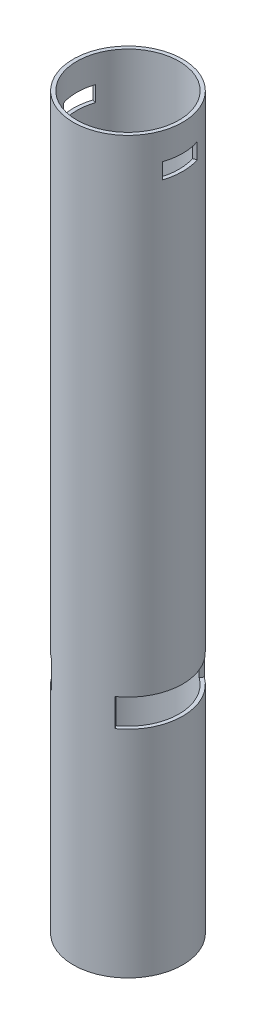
ISO-10303-21;
HEADER;
FILE_DESCRIPTION(('STEP AP214'),'2;1');
FILE_NAME('part.step','',(''),(''),'','','');
FILE_SCHEMA(('AUTOMOTIVE_DESIGN { 1 0 10303 214 1 1 1 1 }'));
ENDSEC;
DATA;
#1=APPLICATION_CONTEXT('core data for automotive mechanical design processes');
#2=APPLICATION_PROTOCOL_DEFINITION('international standard','automotive_design',2000,#1);
#3=PRODUCT_CONTEXT('',#1,'mechanical');
#4=PRODUCT('Part','Part','',(#3));
#5=PRODUCT_RELATED_PRODUCT_CATEGORY('part','',(#4));
#6=PRODUCT_DEFINITION_FORMATION('','',#4);
#7=PRODUCT_DEFINITION_CONTEXT('part definition',#1,'design');
#8=PRODUCT_DEFINITION('design','',#6,#7);
#9=PRODUCT_DEFINITION_SHAPE('','',#8);
#10=(LENGTH_UNIT() NAMED_UNIT(*) SI_UNIT(.MILLI.,.METRE.));
#11=(NAMED_UNIT(*) PLANE_ANGLE_UNIT() SI_UNIT($,.RADIAN.));
#12=(NAMED_UNIT(*) SI_UNIT($,.STERADIAN.) SOLID_ANGLE_UNIT());
#13=UNCERTAINTY_MEASURE_WITH_UNIT(LENGTH_MEASURE(1.E-05),#10,'distance_accuracy_value','');
#14=(GEOMETRIC_REPRESENTATION_CONTEXT(3) GLOBAL_UNCERTAINTY_ASSIGNED_CONTEXT((#13)) GLOBAL_UNIT_ASSIGNED_CONTEXT((#10,
#11,#12)) REPRESENTATION_CONTEXT('',''));
#15=CARTESIAN_POINT('',(0.,0.,0.));
#16=DIRECTION('',(0.,0.,1.));
#17=DIRECTION('',(1.,0.,0.));
#18=AXIS2_PLACEMENT_3D('',#15,#16,#17);
#19=CARTESIAN_POINT('',(0.,2100.,0.));
#20=DIRECTION('',(0.,-1.,0.));
#21=DIRECTION('',(0.,0.,-1.));
#22=AXIS2_PLACEMENT_3D('',#19,#20,#21);
#23=CYLINDRICAL_SURFACE('',#22,146.9);
#24=CARTESIAN_POINT('',(0.,2022.5,0.));
#25=DIRECTION('',(0.,-1.,0.));
#26=DIRECTION('',(0.,0.,-1.));
#27=AXIS2_PLACEMENT_3D('',#24,#25,#26);
#28=CIRCLE('',#27,146.9);
#29=CARTESIAN_POINT('',(139.465403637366,2022.5,-46.1412092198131));
#30=VERTEX_POINT('',#29);
#31=CARTESIAN_POINT('',(139.465403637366,2022.5,46.1412092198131));
#32=VERTEX_POINT('',#31);
#33=EDGE_CURVE('E306',#30,#32,#28,.T.);
#34=ORIENTED_EDGE('',*,*,#33,.T.);
#35=DIRECTION('',(0.,-1.,0.));
#36=VECTOR('',#35,1.);
#37=CARTESIAN_POINT('',(139.465403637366,2100.,46.1412092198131));
#38=LINE('',#37,#36);
#39=CARTESIAN_POINT('',(139.465403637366,1977.5,46.1412092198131));
#40=VERTEX_POINT('',#39);
#41=EDGE_CURVE('E312',#32,#40,#38,.T.);
#42=ORIENTED_EDGE('',*,*,#41,.T.);
#43=CARTESIAN_POINT('',(0.,1977.5,0.));
#44=DIRECTION('',(0.,1.,0.));
#45=DIRECTION('',(0.,0.,1.));
#46=AXIS2_PLACEMENT_3D('',#43,#44,#45);
#47=CIRCLE('',#46,146.9);
#48=CARTESIAN_POINT('',(139.465403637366,1977.5,-46.1412092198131));
#49=VERTEX_POINT('',#48);
#50=EDGE_CURVE('E309',#40,#49,#47,.T.);
#51=ORIENTED_EDGE('',*,*,#50,.T.);
#52=DIRECTION('',(0.,-1.,0.));
#53=VECTOR('',#52,1.);
#54=CARTESIAN_POINT('',(139.465403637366,2100.,-46.1412092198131));
#55=LINE('',#54,#53);
#56=EDGE_CURVE('E304',#30,#49,#55,.T.);
#57=ORIENTED_EDGE('',*,*,#56,.F.);
#58=EDGE_LOOP('',(#34,#42,#51,#57));
#59=FACE_BOUND('',#58,.T.);
#60=CARTESIAN_POINT('',(0.,700.,0.));
#61=DIRECTION('',(0.,-1.,0.));
#62=DIRECTION('',(0.,0.,-1.));
#63=AXIS2_PLACEMENT_3D('',#60,#61,#62);
#64=CIRCLE('',#63,146.9);
#65=CARTESIAN_POINT('',(85.1695347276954,700.,-119.690268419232));
#66=VERTEX_POINT('',#65);
#67=CARTESIAN_POINT('',(85.1695347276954,700.,119.690268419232));
#68=VERTEX_POINT('',#67);
#69=EDGE_CURVE('E285',#66,#68,#64,.T.);
#70=ORIENTED_EDGE('',*,*,#69,.T.);
#71=DIRECTION('',(0.,-1.,0.));
#72=VECTOR('',#71,1.);
#73=CARTESIAN_POINT('',(85.1695347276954,2100.,119.690268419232));
#74=LINE('',#73,#72);
#75=CARTESIAN_POINT('',(85.1695347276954,620.,119.690268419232));
#76=VERTEX_POINT('',#75);
#77=EDGE_CURVE('E291',#68,#76,#74,.T.);
#78=ORIENTED_EDGE('',*,*,#77,.T.);
#79=CARTESIAN_POINT('',(0.,620.,0.));
#80=DIRECTION('',(0.,1.,0.));
#81=DIRECTION('',(0.,0.,1.));
#82=AXIS2_PLACEMENT_3D('',#79,#80,#81);
#83=CIRCLE('',#82,146.9);
#84=CARTESIAN_POINT('',(85.1695347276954,620.,-119.690268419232));
#85=VERTEX_POINT('',#84);
#86=EDGE_CURVE('E288',#76,#85,#83,.T.);
#87=ORIENTED_EDGE('',*,*,#86,.T.);
#88=DIRECTION('',(0.,-1.,0.));
#89=VECTOR('',#88,1.);
#90=CARTESIAN_POINT('',(85.1695347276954,2100.,-119.690268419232));
#91=LINE('',#90,#89);
#92=EDGE_CURVE('E281',#66,#85,#91,.T.);
#93=ORIENTED_EDGE('',*,*,#92,.F.);
#94=EDGE_LOOP('',(#70,#78,#87,#93));
#95=FACE_BOUND('',#94,.T.);
#96=CARTESIAN_POINT('',(0.,2100.,0.));
#97=DIRECTION('',(0.,1.,0.));
#98=DIRECTION('',(0.,0.,1.));
#99=AXIS2_PLACEMENT_3D('',#96,#97,#98);
#100=CIRCLE('',#99,146.9);
#101=CARTESIAN_POINT('',(0.,2100.,146.9));
#102=VERTEX_POINT('',#101);
#103=EDGE_CURVE('E272',#102,#102,#100,.T.);
#104=ORIENTED_EDGE('',*,*,#103,.T.);
#105=EDGE_LOOP('',(#104));
#106=FACE_BOUND('',#105,.T.);
#107=CARTESIAN_POINT('',(0.,0.,0.));
#108=DIRECTION('',(0.,1.,0.));
#109=DIRECTION('',(0.,0.,1.));
#110=AXIS2_PLACEMENT_3D('',#107,#108,#109);
#111=CIRCLE('',#110,146.9);
#112=CARTESIAN_POINT('',(0.,0.,146.9));
#113=VERTEX_POINT('',#112);
#114=EDGE_CURVE('E271',#113,#113,#111,.T.);
#115=ORIENTED_EDGE('',*,*,#114,.F.);
#116=EDGE_LOOP('',(#115));
#117=FACE_BOUND('',#116,.T.);
#118=CARTESIAN_POINT('',(0.,700.,0.));
#119=DIRECTION('',(0.,1.,0.));
#120=DIRECTION('',(0.,0.,1.));
#121=AXIS2_PLACEMENT_3D('',#118,#119,#120);
#122=CIRCLE('',#121,146.9);
#123=CARTESIAN_POINT('',(-85.1695347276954,700.,-119.690268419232));
#124=VERTEX_POINT('',#123);
#125=CARTESIAN_POINT('',(-85.1695347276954,700.,119.690268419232));
#126=VERTEX_POINT('',#125);
#127=EDGE_CURVE('E296',#124,#126,#122,.T.);
#128=ORIENTED_EDGE('',*,*,#127,.F.);
#129=DIRECTION('',(0.,-1.,0.));
#130=VECTOR('',#129,1.);
#131=CARTESIAN_POINT('',(-85.1695347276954,2100.,-119.690268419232));
#132=LINE('',#131,#130);
#133=CARTESIAN_POINT('',(-85.1695347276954,620.,-119.690268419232));
#134=VERTEX_POINT('',#133);
#135=EDGE_CURVE('E301',#124,#134,#132,.T.);
#136=ORIENTED_EDGE('',*,*,#135,.T.);
#137=CARTESIAN_POINT('',(0.,620.,0.));
#138=DIRECTION('',(0.,-1.,0.));
#139=DIRECTION('',(0.,0.,-1.));
#140=AXIS2_PLACEMENT_3D('',#137,#138,#139);
#141=CIRCLE('',#140,146.9);
#142=CARTESIAN_POINT('',(-85.1695347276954,620.,119.690268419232));
#143=VERTEX_POINT('',#142);
#144=EDGE_CURVE('E299',#143,#134,#141,.T.);
#145=ORIENTED_EDGE('',*,*,#144,.F.);
#146=DIRECTION('',(0.,-1.,0.));
#147=VECTOR('',#146,1.);
#148=CARTESIAN_POINT('',(-85.1695347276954,2100.,119.690268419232));
#149=LINE('',#148,#147);
#150=EDGE_CURVE('E294',#126,#143,#149,.T.);
#151=ORIENTED_EDGE('',*,*,#150,.F.);
#152=EDGE_LOOP('',(#128,#136,#145,#151));
#153=FACE_BOUND('',#152,.T.);
#154=CARTESIAN_POINT('',(0.,2022.5,0.));
#155=DIRECTION('',(0.,1.,0.));
#156=DIRECTION('',(0.,0.,1.));
#157=AXIS2_PLACEMENT_3D('',#154,#155,#156);
#158=CIRCLE('',#157,146.9);
#159=CARTESIAN_POINT('',(-139.651820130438,2022.5,-45.573886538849));
#160=VERTEX_POINT('',#159);
#161=CARTESIAN_POINT('',(-139.651820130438,2022.5,45.573886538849));
#162=VERTEX_POINT('',#161);
#163=EDGE_CURVE('E316',#160,#162,#158,.T.);
#164=ORIENTED_EDGE('',*,*,#163,.F.);
#165=DIRECTION('',(0.,-1.,0.));
#166=VECTOR('',#165,1.);
#167=CARTESIAN_POINT('',(-139.651820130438,2100.,-45.573886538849));
#168=LINE('',#167,#166);
#169=CARTESIAN_POINT('',(-139.651820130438,1977.5,-45.573886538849));
#170=VERTEX_POINT('',#169);
#171=EDGE_CURVE('E320',#160,#170,#168,.T.);
#172=ORIENTED_EDGE('',*,*,#171,.T.);
#173=CARTESIAN_POINT('',(0.,1977.5,0.));
#174=DIRECTION('',(0.,-1.,0.));
#175=DIRECTION('',(0.,0.,-1.));
#176=AXIS2_PLACEMENT_3D('',#173,#174,#175);
#177=CIRCLE('',#176,146.9);
#178=CARTESIAN_POINT('',(-139.651820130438,1977.5,45.573886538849));
#179=VERTEX_POINT('',#178);
#180=EDGE_CURVE('E318',#179,#170,#177,.T.);
#181=ORIENTED_EDGE('',*,*,#180,.F.);
#182=DIRECTION('',(0.,-1.,0.));
#183=VECTOR('',#182,1.);
#184=CARTESIAN_POINT('',(-139.651820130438,2100.,45.573886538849));
#185=LINE('',#184,#183);
#186=EDGE_CURVE('E187',#162,#179,#185,.T.);
#187=ORIENTED_EDGE('',*,*,#186,.F.);
#188=EDGE_LOOP('',(#164,#172,#181,#187));
#189=FACE_BOUND('',#188,.T.);
#190=ADVANCED_FACE('F32',(#59,#95,#106,#117,#153,#189),#23,.F.);
#191=CARTESIAN_POINT('',(0.,2100.,0.));
#192=DIRECTION('',(0.,-1.,0.));
#193=DIRECTION('',(0.,0.,-1.));
#194=AXIS2_PLACEMENT_3D('',#191,#192,#193);
#195=CYLINDRICAL_SURFACE('',#194,157.5);
#196=CARTESIAN_POINT('',(-149.676780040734,1977.49481108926,49.0215413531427));
#197=CARTESIAN_POINT('',(-150.271889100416,1977.49520185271,47.2045564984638));
#198=CARTESIAN_POINT('',(-150.833881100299,1977.49557175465,45.3767263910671));
#199=CARTESIAN_POINT('',(-151.890954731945,1977.49626886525,41.7018230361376));
#200=CARTESIAN_POINT('',(-152.386036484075,1977.49659607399,39.8547498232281));
#201=CARTESIAN_POINT('',(-153.30862101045,1977.49720683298,36.143778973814));
#202=CARTESIAN_POINT('',(-153.736122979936,1977.49749038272,34.2798811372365));
#203=CARTESIAN_POINT('',(-154.522978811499,1977.49801300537,30.5377566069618));
#204=CARTESIAN_POINT('',(-154.882332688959,1977.4982520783,28.6595299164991));
#205=CARTESIAN_POINT('',(-155.53283607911,1977.49868533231,24.8887940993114));
#206=CARTESIAN_POINT('',(-155.823896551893,1977.49887945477,22.9962696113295));
#207=CARTESIAN_POINT('',(-156.336844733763,1977.49922185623,19.2017350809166));
#208=CARTESIAN_POINT('',(-156.55872761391,1977.49937013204,17.2997243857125));
#209=CARTESIAN_POINT('',(-156.932977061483,1977.49962037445,13.4890901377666));
#210=CARTESIAN_POINT('',(-157.08535137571,1977.49972234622,11.5804673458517));
#211=CARTESIAN_POINT('',(-157.320425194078,1977.49987971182,7.75881029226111));
#212=CARTESIAN_POINT('',(-157.40312013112,1977.4999351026,5.84577574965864));
#213=CARTESIAN_POINT('',(-157.498722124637,1977.49999914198,2.01741344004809));
#214=CARTESIAN_POINT('',(-157.511609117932,1977.50000777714,0.102085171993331));
#215=CARTESIAN_POINT('',(-157.467524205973,1977.49997824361,-3.7277672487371));
#216=CARTESIAN_POINT('',(-157.410552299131,1977.4999400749,-5.6422914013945));
#217=CARTESIAN_POINT('',(-157.22681097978,1977.49981703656,-9.46828863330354));
#218=CARTESIAN_POINT('',(-157.100030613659,1977.49973215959,-11.3797611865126));
#219=CARTESIAN_POINT('',(-156.776844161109,1977.49951595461,-15.1966848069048));
#220=CARTESIAN_POINT('',(-156.580442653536,1977.49938462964,-17.1021362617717));
#221=CARTESIAN_POINT('',(-156.118690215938,1977.49907619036,-20.901183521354));
#222=CARTESIAN_POINT('',(-155.853464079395,1977.49889915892,-22.7947944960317));
#223=CARTESIAN_POINT('',(-155.254267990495,1977.4984997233,-26.5709734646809));
#224=CARTESIAN_POINT('',(-154.920302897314,1977.49827732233,-28.4535422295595));
#225=CARTESIAN_POINT('',(-154.184200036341,1977.49778787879,-32.2045674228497));
#226=CARTESIAN_POINT('',(-153.782087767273,1977.49752085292,-34.0730288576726));
#227=CARTESIAN_POINT('',(-152.910166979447,1977.49694289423,-37.7939376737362));
#228=CARTESIAN_POINT('',(-152.440364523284,1977.49663196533,-39.6463864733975));
#229=CARTESIAN_POINT('',(-151.591616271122,1977.49607140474,-42.7545475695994));
#230=CARTESIAN_POINT('',(-151.230412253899,1977.49583314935,-44.015129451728));
#231=CARTESIAN_POINT('',(-150.665225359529,1977.49546091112,-45.8984646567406));
#232=CARTESIAN_POINT('',(-150.473006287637,1977.49533440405,-46.5247627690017));
#233=CARTESIAN_POINT('',(-150.080747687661,1977.4950764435,-47.7749772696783));
#234=CARTESIAN_POINT('',(-149.880707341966,1977.4949449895,-48.3988934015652));
#235=CARTESIAN_POINT('',(-149.676780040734,1977.49481108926,-49.0215413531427));
#236=B_SPLINE_CURVE_WITH_KNOTS('',3,(#196,#197,#198,#199,#200,#201,#202,#203,#204,#205,#206,
#207,#208,#209,#210,#211,#212,#213,#214,#215,#216,#217,#218,#219,#220,#221,#222,#223,#224,#225,
#226,#227,#228,#229,#230,#231,#232,#233,#234,#235),.UNSPECIFIED.,.F.,.F.,(4,2,2,2,2,2,2,2,2,2,2,
2,2,2,2,2,2,2,2,4),(0.,5.73555956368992,11.4711088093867,17.2067263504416,22.9423425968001,
28.6853958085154,34.4288498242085,40.171663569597,45.9148536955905,51.6596943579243,
57.4045351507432,63.1502776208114,68.8956422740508,74.6306612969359,80.3652750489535,
86.0977477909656,91.8297074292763,95.763232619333,97.7285812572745,99.6941358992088),.UNSPECIFIED.);
#237=CARTESIAN_POINT('',(-149.722120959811,1977.49484086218,48.882885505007));
#238=VERTEX_POINT('',#237);
#239=CARTESIAN_POINT('',(-157.5,1977.5,0.));
#240=VERTEX_POINT('',#239);
#241=EDGE_CURVE('E37',#238,#240,#236,.T.);
#242=ORIENTED_EDGE('',*,*,#241,.T.);
#243=CARTESIAN_POINT('',(-149.722120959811,1977.49484086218,-48.882885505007));
#244=VERTEX_POINT('',#243);
#245=EDGE_CURVE('E11',#240,#244,#236,.T.);
#246=ORIENTED_EDGE('',*,*,#245,.T.);
#247=DIRECTION('',(0.,-1.,0.));
#248=VECTOR('',#247,1.);
#249=CARTESIAN_POINT('',(-149.722120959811,2100.,-48.882885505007));
#250=LINE('',#249,#248);
#251=CARTESIAN_POINT('',(-149.722120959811,2022.50515913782,-48.882885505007));
#252=VERTEX_POINT('',#251);
#253=EDGE_CURVE('E206',#252,#244,#250,.T.);
#254=ORIENTED_EDGE('',*,*,#253,.F.);
#255=CARTESIAN_POINT('',(-149.676780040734,2022.50518891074,-49.0215413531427));
#256=CARTESIAN_POINT('',(-150.271889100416,2022.50479814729,-47.2045564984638));
#257=CARTESIAN_POINT('',(-150.833881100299,2022.50442824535,-45.3767263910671));
#258=CARTESIAN_POINT('',(-151.890954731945,2022.50373113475,-41.7018230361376));
#259=CARTESIAN_POINT('',(-152.386036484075,2022.50340392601,-39.8547498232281));
#260=CARTESIAN_POINT('',(-153.30862101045,2022.50279316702,-36.143778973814));
#261=CARTESIAN_POINT('',(-153.736122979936,2022.50250961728,-34.2798811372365));
#262=CARTESIAN_POINT('',(-154.522978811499,2022.50198699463,-30.5377566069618));
#263=CARTESIAN_POINT('',(-154.882332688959,2022.5017479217,-28.6595299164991));
#264=CARTESIAN_POINT('',(-155.53283607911,2022.50131466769,-24.8887940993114));
#265=CARTESIAN_POINT('',(-155.823896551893,2022.50112054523,-22.9962696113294));
#266=CARTESIAN_POINT('',(-156.336844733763,2022.50077814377,-19.2017350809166));
#267=CARTESIAN_POINT('',(-156.55872761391,2022.50062986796,-17.2997243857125));
#268=CARTESIAN_POINT('',(-156.932977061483,2022.50037962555,-13.4890901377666));
#269=CARTESIAN_POINT('',(-157.08535137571,2022.50027765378,-11.5804673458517));
#270=CARTESIAN_POINT('',(-157.320425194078,2022.50012028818,-7.75881029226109));
#271=CARTESIAN_POINT('',(-157.40312013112,2022.5000648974,-5.84577574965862));
#272=CARTESIAN_POINT('',(-157.498722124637,2022.50000085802,-2.01741344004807));
#273=CARTESIAN_POINT('',(-157.511609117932,2022.49999222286,-0.102085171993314));
#274=CARTESIAN_POINT('',(-157.467524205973,2022.50002175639,3.72776724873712));
#275=CARTESIAN_POINT('',(-157.410552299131,2022.5000599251,5.64229140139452));
#276=CARTESIAN_POINT('',(-157.22681097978,2022.50018296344,9.46828863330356));
#277=CARTESIAN_POINT('',(-157.100030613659,2022.50026784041,11.3797611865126));
#278=CARTESIAN_POINT('',(-156.776844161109,2022.50048404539,15.1966848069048));
#279=CARTESIAN_POINT('',(-156.580442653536,2022.50061537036,17.1021362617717));
#280=CARTESIAN_POINT('',(-156.118690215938,2022.50092380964,20.901183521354));
#281=CARTESIAN_POINT('',(-155.853464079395,2022.50110084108,22.7947944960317));
#282=CARTESIAN_POINT('',(-155.254267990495,2022.5015002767,26.5709734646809));
#283=CARTESIAN_POINT('',(-154.920302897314,2022.50172267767,28.4535422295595));
#284=CARTESIAN_POINT('',(-154.184200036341,2022.50221212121,32.2045674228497));
#285=CARTESIAN_POINT('',(-153.782087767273,2022.50247914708,34.0730288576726));
#286=CARTESIAN_POINT('',(-152.910166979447,2022.50305710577,37.7939376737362));
#287=CARTESIAN_POINT('',(-152.440364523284,2022.50336803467,39.6463864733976));
#288=CARTESIAN_POINT('',(-151.591616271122,2022.50392859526,42.7545475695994));
#289=CARTESIAN_POINT('',(-151.230412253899,2022.50416685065,44.0151294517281));
#290=CARTESIAN_POINT('',(-150.665225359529,2022.50453908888,45.8984646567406));
#291=CARTESIAN_POINT('',(-150.473006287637,2022.50466559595,46.5247627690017));
#292=CARTESIAN_POINT('',(-150.080747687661,2022.5049235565,47.7749772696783));
#293=CARTESIAN_POINT('',(-149.880707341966,2022.5050550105,48.3988934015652));
#294=CARTESIAN_POINT('',(-149.676780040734,2022.50518891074,49.0215413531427));
#295=B_SPLINE_CURVE_WITH_KNOTS('',3,(#255,#256,#257,#258,#259,#260,#261,#262,#263,#264,#265,
#266,#267,#268,#269,#270,#271,#272,#273,#274,#275,#276,#277,#278,#279,#280,#281,#282,#283,#284,
#285,#286,#287,#288,#289,#290,#291,#292,#293,#294),.UNSPECIFIED.,.F.,.F.,(4,2,2,2,2,2,2,2,2,2,2,
2,2,2,2,2,2,2,2,4),(0.,5.7355595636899,11.4711088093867,17.2067263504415,22.9423425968,
28.6853958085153,34.4288498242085,40.171663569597,45.9148536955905,51.6596943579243,
57.4045351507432,63.1502776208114,68.8956422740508,74.6306612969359,80.3652750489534,
86.0977477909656,91.8297074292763,95.763232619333,97.7285812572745,99.6941358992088),.UNSPECIFIED.);
#296=CARTESIAN_POINT('',(-157.5,2022.5,0.));
#297=VERTEX_POINT('',#296);
#298=EDGE_CURVE('E327',#252,#297,#295,.T.);
#299=ORIENTED_EDGE('',*,*,#298,.T.);
#300=CARTESIAN_POINT('',(-149.722120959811,2022.50515913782,48.882885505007));
#301=VERTEX_POINT('',#300);
#302=EDGE_CURVE('E322',#297,#301,#295,.T.);
#303=ORIENTED_EDGE('',*,*,#302,.T.);
#304=DIRECTION('',(0.,-1.,0.));
#305=VECTOR('',#304,1.);
#306=CARTESIAN_POINT('',(-149.722120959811,2100.,48.882885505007));
#307=LINE('',#306,#305);
#308=EDGE_CURVE('E204',#301,#238,#307,.T.);
#309=ORIENTED_EDGE('',*,*,#308,.T.);
#310=EDGE_LOOP('',(#242,#246,#254,#299,#303,#309));
#311=FACE_BOUND('',#310,.T.);
#312=DIRECTION('',(0.,-1.,0.));
#313=VECTOR('',#312,1.);
#314=CARTESIAN_POINT('',(-91.3151921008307,700.,-128.326870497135));
#315=LINE('',#314,#313);
#316=CARTESIAN_POINT('',(-91.3151921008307,700.,-128.326870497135));
#317=VERTEX_POINT('',#316);
#318=CARTESIAN_POINT('',(-91.3151921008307,620.,-128.326870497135));
#319=VERTEX_POINT('',#318);
#320=EDGE_CURVE('E241',#317,#319,#315,.T.);
#321=ORIENTED_EDGE('',*,*,#320,.F.);
#322=CARTESIAN_POINT('',(0.,700.,0.));
#323=DIRECTION('',(0.,1.,0.));
#324=DIRECTION('',(0.,0.,1.));
#325=AXIS2_PLACEMENT_3D('',#322,#323,#324);
#326=CIRCLE('',#325,157.5);
#327=CARTESIAN_POINT('',(-91.3151921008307,700.,128.326870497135));
#328=VERTEX_POINT('',#327);
#329=EDGE_CURVE('E247',#317,#328,#326,.T.);
#330=ORIENTED_EDGE('',*,*,#329,.T.);
#331=DIRECTION('',(0.,-1.,0.));
#332=VECTOR('',#331,1.);
#333=CARTESIAN_POINT('',(-91.3151921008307,700.,128.326870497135));
#334=LINE('',#333,#332);
#335=CARTESIAN_POINT('',(-91.3151921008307,620.,128.326870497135));
#336=VERTEX_POINT('',#335);
#337=EDGE_CURVE('E233',#328,#336,#334,.T.);
#338=ORIENTED_EDGE('',*,*,#337,.T.);
#339=CARTESIAN_POINT('',(0.,620.,0.));
#340=DIRECTION('',(0.,1.,0.));
#341=DIRECTION('',(0.,0.,1.));
#342=AXIS2_PLACEMENT_3D('',#339,#340,#341);
#343=CIRCLE('',#342,157.5);
#344=EDGE_CURVE('E244',#319,#336,#343,.T.);
#345=ORIENTED_EDGE('',*,*,#344,.F.);
#346=EDGE_LOOP('',(#321,#330,#338,#345));
#347=FACE_BOUND('',#346,.T.);
#348=CARTESIAN_POINT('',(0.,0.,0.));
#349=DIRECTION('',(0.,1.,0.));
#350=DIRECTION('',(0.,0.,1.));
#351=AXIS2_PLACEMENT_3D('',#348,#349,#350);
#352=CIRCLE('',#351,157.5);
#353=CARTESIAN_POINT('',(0.,0.,157.5));
#354=VERTEX_POINT('',#353);
#355=EDGE_CURVE('E275',#354,#354,#352,.T.);
#356=ORIENTED_EDGE('',*,*,#355,.T.);
#357=EDGE_LOOP('',(#356));
#358=FACE_BOUND('',#357,.T.);
#359=CARTESIAN_POINT('',(0.,2100.,0.));
#360=DIRECTION('',(0.,1.,0.));
#361=DIRECTION('',(0.,0.,1.));
#362=AXIS2_PLACEMENT_3D('',#359,#360,#361);
#363=CIRCLE('',#362,157.5);
#364=CARTESIAN_POINT('',(0.,2100.,157.5));
#365=VERTEX_POINT('',#364);
#366=EDGE_CURVE('E278',#365,#365,#363,.T.);
#367=ORIENTED_EDGE('',*,*,#366,.F.);
#368=EDGE_LOOP('',(#367));
#369=FACE_BOUND('',#368,.T.);
#370=DIRECTION('',(0.,1.,0.));
#371=VECTOR('',#370,1.);
#372=CARTESIAN_POINT('',(91.3151921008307,700.,128.326870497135));
#373=LINE('',#372,#371);
#374=CARTESIAN_POINT('',(91.3151921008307,620.,128.326870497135));
#375=VERTEX_POINT('',#374);
#376=CARTESIAN_POINT('',(91.3151921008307,700.,128.326870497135));
#377=VERTEX_POINT('',#376);
#378=EDGE_CURVE('E258',#375,#377,#373,.T.);
#379=ORIENTED_EDGE('',*,*,#378,.T.);
#380=CARTESIAN_POINT('',(0.,700.,0.));
#381=DIRECTION('',(0.,1.,0.));
#382=DIRECTION('',(0.,0.,1.));
#383=AXIS2_PLACEMENT_3D('',#380,#381,#382);
#384=CIRCLE('',#383,157.5);
#385=CARTESIAN_POINT('',(91.3151921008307,700.,-128.326870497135));
#386=VERTEX_POINT('',#385);
#387=EDGE_CURVE('E266',#377,#386,#384,.T.);
#388=ORIENTED_EDGE('',*,*,#387,.T.);
#389=DIRECTION('',(0.,1.,0.));
#390=VECTOR('',#389,1.);
#391=CARTESIAN_POINT('',(91.3151921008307,700.,-128.326870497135));
#392=LINE('',#391,#390);
#393=CARTESIAN_POINT('',(91.3151921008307,620.,-128.326870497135));
#394=VERTEX_POINT('',#393);
#395=EDGE_CURVE('E250',#394,#386,#392,.T.);
#396=ORIENTED_EDGE('',*,*,#395,.F.);
#397=CARTESIAN_POINT('',(0.,620.,0.));
#398=DIRECTION('',(0.,1.,0.));
#399=DIRECTION('',(0.,0.,1.));
#400=AXIS2_PLACEMENT_3D('',#397,#398,#399);
#401=CIRCLE('',#400,157.5);
#402=EDGE_CURVE('E269',#375,#394,#401,.T.);
#403=ORIENTED_EDGE('',*,*,#402,.F.);
#404=EDGE_LOOP('',(#379,#388,#396,#403));
#405=FACE_BOUND('',#404,.T.);
#406=DIRECTION('',(0.,-1.,0.));
#407=VECTOR('',#406,1.);
#408=CARTESIAN_POINT('',(149.53570446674,2100.,49.450208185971));
#409=LINE('',#408,#407);
#410=CARTESIAN_POINT('',(149.53570446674,2022.5,49.450208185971));
#411=VERTEX_POINT('',#410);
#412=CARTESIAN_POINT('',(149.53570446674,1977.5,49.450208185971));
#413=VERTEX_POINT('',#412);
#414=EDGE_CURVE('E222',#411,#413,#409,.T.);
#415=ORIENTED_EDGE('',*,*,#414,.F.);
#416=CARTESIAN_POINT('',(0.,2022.5,0.));
#417=DIRECTION('',(0.,-1.,0.));
#418=DIRECTION('',(0.,0.,-1.));
#419=AXIS2_PLACEMENT_3D('',#416,#417,#418);
#420=CIRCLE('',#419,157.5);
#421=CARTESIAN_POINT('',(149.53570446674,2022.5,-49.450208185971));
#422=VERTEX_POINT('',#421);
#423=EDGE_CURVE('E224',#422,#411,#420,.T.);
#424=ORIENTED_EDGE('',*,*,#423,.F.);
#425=DIRECTION('',(0.,-1.,0.));
#426=VECTOR('',#425,1.);
#427=CARTESIAN_POINT('',(149.53570446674,2100.,-49.450208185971));
#428=LINE('',#427,#426);
#429=CARTESIAN_POINT('',(149.53570446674,1977.5,-49.450208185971));
#430=VERTEX_POINT('',#429);
#431=EDGE_CURVE('E219',#422,#430,#428,.T.);
#432=ORIENTED_EDGE('',*,*,#431,.T.);
#433=CARTESIAN_POINT('',(0.,1977.5,0.));
#434=DIRECTION('',(0.,1.,0.));
#435=DIRECTION('',(0.,0.,1.));
#436=AXIS2_PLACEMENT_3D('',#433,#434,#435);
#437=CIRCLE('',#436,157.5);
#438=EDGE_CURVE('E226',#413,#430,#437,.T.);
#439=ORIENTED_EDGE('',*,*,#438,.F.);
#440=EDGE_LOOP('',(#415,#424,#432,#439));
#441=FACE_BOUND('',#440,.T.);
#442=ADVANCED_FACE('F34',(#311,#347,#358,#369,#405,#441),#195,.T.);
#443=CARTESIAN_POINT('',(0.,2100.,0.));
#444=DIRECTION('',(0.,1.,0.));
#445=DIRECTION('',(0.,0.,1.));
#446=AXIS2_PLACEMENT_3D('',#443,#444,#445);
#447=PLANE('',#446);
#448=ORIENTED_EDGE('',*,*,#366,.T.);
#449=EDGE_LOOP('',(#448));
#450=FACE_BOUND('',#449,.T.);
#451=ORIENTED_EDGE('',*,*,#103,.F.);
#452=EDGE_LOOP('',(#451));
#453=FACE_BOUND('',#452,.T.);
#454=ADVANCED_FACE('F395',(#450,#453),#447,.T.);
#455=CARTESIAN_POINT('',(0.,0.,0.));
#456=DIRECTION('',(0.,1.,0.));
#457=DIRECTION('',(0.,0.,1.));
#458=AXIS2_PLACEMENT_3D('',#455,#456,#457);
#459=PLANE('',#458);
#460=ORIENTED_EDGE('',*,*,#355,.F.);
#461=EDGE_LOOP('',(#460));
#462=FACE_BOUND('',#461,.T.);
#463=ORIENTED_EDGE('',*,*,#114,.T.);
#464=EDGE_LOOP('',(#463));
#465=FACE_BOUND('',#464,.T.);
#466=ADVANCED_FACE('F390',(#462,#465),#459,.F.);
#467=CARTESIAN_POINT('',(91.3151921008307,620.,128.326870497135));
#468=DIRECTION('',(0.,1.,0.));
#469=DIRECTION('',(0.,0.,1.));
#470=AXIS2_PLACEMENT_3D('',#467,#468,#469);
#471=PLANE('',#470);
#472=DIRECTION('',(0.579778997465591,0.,0.814773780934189));
#473=VECTOR('',#472,1.);
#474=CARTESIAN_POINT('',(91.3151921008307,620.,128.326870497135));
#475=LINE('',#474,#473);
#476=EDGE_CURVE('E264',#76,#375,#475,.T.);
#477=ORIENTED_EDGE('',*,*,#476,.T.);
#478=ORIENTED_EDGE('',*,*,#402,.T.);
#479=DIRECTION('',(0.579778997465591,0.,-0.814773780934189));
#480=VECTOR('',#479,1.);
#481=CARTESIAN_POINT('',(91.3151921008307,620.,-128.326870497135));
#482=LINE('',#481,#480);
#483=EDGE_CURVE('E255',#85,#394,#482,.T.);
#484=ORIENTED_EDGE('',*,*,#483,.F.);
#485=ORIENTED_EDGE('',*,*,#86,.F.);
#486=EDGE_LOOP('',(#477,#478,#484,#485));
#487=FACE_BOUND('',#486,.T.);
#488=ADVANCED_FACE('F386',(#487),#471,.T.);
#489=CARTESIAN_POINT('',(91.3151921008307,700.,128.326870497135));
#490=DIRECTION('',(0.,-1.,0.));
#491=DIRECTION('',(0.,0.,-1.));
#492=AXIS2_PLACEMENT_3D('',#489,#490,#491);
#493=PLANE('',#492);
#494=DIRECTION('',(-0.579778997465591,0.,0.814773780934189));
#495=VECTOR('',#494,1.);
#496=CARTESIAN_POINT('',(91.3151921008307,700.,-128.326870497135));
#497=LINE('',#496,#495);
#498=EDGE_CURVE('E253',#386,#66,#497,.T.);
#499=ORIENTED_EDGE('',*,*,#498,.F.);
#500=ORIENTED_EDGE('',*,*,#387,.F.);
#501=DIRECTION('',(-0.579778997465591,0.,-0.814773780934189));
#502=VECTOR('',#501,1.);
#503=CARTESIAN_POINT('',(91.3151921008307,700.,128.326870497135));
#504=LINE('',#503,#502);
#505=EDGE_CURVE('E261',#377,#68,#504,.T.);
#506=ORIENTED_EDGE('',*,*,#505,.T.);
#507=ORIENTED_EDGE('',*,*,#69,.F.);
#508=EDGE_LOOP('',(#499,#500,#506,#507));
#509=FACE_BOUND('',#508,.T.);
#510=ADVANCED_FACE('F382',(#509),#493,.T.);
#511=CARTESIAN_POINT('',(91.3151921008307,620.,128.326870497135));
#512=DIRECTION('',(0.814773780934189,0.,-0.579778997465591));
#513=DIRECTION('',(-0.579778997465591,0.,-0.814773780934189));
#514=AXIS2_PLACEMENT_3D('',#511,#512,#513);
#515=PLANE('',#514);
#516=ORIENTED_EDGE('',*,*,#505,.F.);
#517=ORIENTED_EDGE('',*,*,#378,.F.);
#518=ORIENTED_EDGE('',*,*,#476,.F.);
#519=ORIENTED_EDGE('',*,*,#77,.F.);
#520=EDGE_LOOP('',(#516,#517,#518,#519));
#521=FACE_BOUND('',#520,.T.);
#522=ADVANCED_FACE('F378',(#521),#515,.T.);
#523=CARTESIAN_POINT('',(91.3151921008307,620.,-128.326870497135));
#524=DIRECTION('',(-0.814773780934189,0.,-0.579778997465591));
#525=DIRECTION('',(-0.579778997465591,0.,0.814773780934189));
#526=AXIS2_PLACEMENT_3D('',#523,#524,#525);
#527=PLANE('',#526);
#528=ORIENTED_EDGE('',*,*,#92,.T.);
#529=ORIENTED_EDGE('',*,*,#483,.T.);
#530=ORIENTED_EDGE('',*,*,#395,.T.);
#531=ORIENTED_EDGE('',*,*,#498,.T.);
#532=EDGE_LOOP('',(#528,#529,#530,#531));
#533=FACE_BOUND('',#532,.T.);
#534=ADVANCED_FACE('F371',(#533),#527,.F.);
#535=CARTESIAN_POINT('',(-17.3933699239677,620.,-24.4432134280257));
#536=DIRECTION('',(0.,-1.,0.));
#537=DIRECTION('',(0.,0.,-1.));
#538=AXIS2_PLACEMENT_3D('',#535,#536,#537);
#539=PLANE('',#538);
#540=ORIENTED_EDGE('',*,*,#144,.T.);
#541=DIRECTION('',(0.579778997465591,0.,0.814773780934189));
#542=VECTOR('',#541,1.);
#543=CARTESIAN_POINT('',(-17.3933699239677,620.,-24.4432134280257));
#544=LINE('',#543,#542);
#545=EDGE_CURVE('E236',#319,#134,#544,.T.);
#546=ORIENTED_EDGE('',*,*,#545,.F.);
#547=ORIENTED_EDGE('',*,*,#344,.T.);
#548=DIRECTION('',(0.579778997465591,0.,-0.814773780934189));
#549=VECTOR('',#548,1.);
#550=CARTESIAN_POINT('',(-17.3933699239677,620.,24.4432134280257));
#551=LINE('',#550,#549);
#552=EDGE_CURVE('E228',#336,#143,#551,.T.);
#553=ORIENTED_EDGE('',*,*,#552,.T.);
#554=EDGE_LOOP('',(#540,#546,#547,#553));
#555=FACE_BOUND('',#554,.T.);
#556=ADVANCED_FACE('F368',(#555),#539,.F.);
#557=CARTESIAN_POINT('',(-17.3933699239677,700.,-24.4432134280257));
#558=DIRECTION('',(0.,1.,0.));
#559=DIRECTION('',(0.,0.,1.));
#560=AXIS2_PLACEMENT_3D('',#557,#558,#559);
#561=PLANE('',#560);
#562=ORIENTED_EDGE('',*,*,#127,.T.);
#563=DIRECTION('',(-0.579778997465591,0.,0.814773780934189));
#564=VECTOR('',#563,1.);
#565=CARTESIAN_POINT('',(-17.3933699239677,700.,24.4432134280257));
#566=LINE('',#565,#564);
#567=EDGE_CURVE('E231',#126,#328,#566,.T.);
#568=ORIENTED_EDGE('',*,*,#567,.T.);
#569=ORIENTED_EDGE('',*,*,#329,.F.);
#570=DIRECTION('',(-0.579778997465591,0.,-0.814773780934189));
#571=VECTOR('',#570,1.);
#572=CARTESIAN_POINT('',(-17.3933699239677,700.,-24.4432134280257));
#573=LINE('',#572,#571);
#574=EDGE_CURVE('E239',#124,#317,#573,.T.);
#575=ORIENTED_EDGE('',*,*,#574,.F.);
#576=EDGE_LOOP('',(#562,#568,#569,#575));
#577=FACE_BOUND('',#576,.T.);
#578=ADVANCED_FACE('F366',(#577),#561,.F.);
#579=CARTESIAN_POINT('',(-91.3151921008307,620.,-128.326870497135));
#580=DIRECTION('',(-0.814773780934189,0.,0.579778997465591));
#581=DIRECTION('',(0.579778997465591,0.,0.814773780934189));
#582=AXIS2_PLACEMENT_3D('',#579,#580,#581);
#583=PLANE('',#582);
#584=ORIENTED_EDGE('',*,*,#574,.T.);
#585=ORIENTED_EDGE('',*,*,#320,.T.);
#586=ORIENTED_EDGE('',*,*,#545,.T.);
#587=ORIENTED_EDGE('',*,*,#135,.F.);
#588=EDGE_LOOP('',(#584,#585,#586,#587));
#589=FACE_BOUND('',#588,.T.);
#590=ADVANCED_FACE('F362',(#589),#583,.T.);
#591=CARTESIAN_POINT('',(-91.3151921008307,620.,128.326870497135));
#592=DIRECTION('',(0.814773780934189,0.,0.579778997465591));
#593=DIRECTION('',(0.579778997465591,0.,-0.814773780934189));
#594=AXIS2_PLACEMENT_3D('',#591,#592,#593);
#595=PLANE('',#594);
#596=ORIENTED_EDGE('',*,*,#150,.T.);
#597=ORIENTED_EDGE('',*,*,#552,.F.);
#598=ORIENTED_EDGE('',*,*,#337,.F.);
#599=ORIENTED_EDGE('',*,*,#567,.F.);
#600=EDGE_LOOP('',(#596,#597,#598,#599));
#601=FACE_BOUND('',#600,.T.);
#602=ADVANCED_FACE('F358',(#601),#595,.F.);
#603=CARTESIAN_POINT('',(13.2939213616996,1977.5,4.68253668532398));
#604=DIRECTION('',(0.,1.,0.));
#605=DIRECTION('',(0.,0.,1.));
#606=AXIS2_PLACEMENT_3D('',#603,#604,#605);
#607=PLANE('',#606);
#608=ORIENTED_EDGE('',*,*,#438,.T.);
#609=DIRECTION('',(0.950026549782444,0.,-0.312169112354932));
#610=VECTOR('',#609,1.);
#611=CARTESIAN_POINT('',(13.2939213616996,1977.5,-4.68253668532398));
#612=LINE('',#611,#610);
#613=EDGE_CURVE('E210',#49,#430,#612,.T.);
#614=ORIENTED_EDGE('',*,*,#613,.F.);
#615=ORIENTED_EDGE('',*,*,#50,.F.);
#616=DIRECTION('',(0.950026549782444,0.,0.312169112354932));
#617=VECTOR('',#616,1.);
#618=CARTESIAN_POINT('',(13.2939213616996,1977.5,4.68253668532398));
#619=LINE('',#618,#617);
#620=EDGE_CURVE('E216',#40,#413,#619,.T.);
#621=ORIENTED_EDGE('',*,*,#620,.T.);
#622=EDGE_LOOP('',(#608,#614,#615,#621));
#623=FACE_BOUND('',#622,.T.);
#624=ADVANCED_FACE('F354',(#623),#607,.T.);
#625=CARTESIAN_POINT('',(13.2939213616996,2022.5,4.68253668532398));
#626=DIRECTION('',(0.,-1.,0.));
#627=DIRECTION('',(0.,0.,-1.));
#628=AXIS2_PLACEMENT_3D('',#625,#626,#627);
#629=PLANE('',#628);
#630=ORIENTED_EDGE('',*,*,#423,.T.);
#631=DIRECTION('',(-0.950026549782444,0.,-0.312169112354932));
#632=VECTOR('',#631,1.);
#633=CARTESIAN_POINT('',(13.2939213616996,2022.5,4.68253668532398));
#634=LINE('',#633,#632);
#635=EDGE_CURVE('E213',#411,#32,#634,.T.);
#636=ORIENTED_EDGE('',*,*,#635,.T.);
#637=ORIENTED_EDGE('',*,*,#33,.F.);
#638=DIRECTION('',(-0.950026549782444,0.,0.312169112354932));
#639=VECTOR('',#638,1.);
#640=CARTESIAN_POINT('',(13.2939213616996,2022.5,-4.68253668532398));
#641=LINE('',#640,#639);
#642=EDGE_CURVE('E208',#422,#30,#641,.T.);
#643=ORIENTED_EDGE('',*,*,#642,.F.);
#644=EDGE_LOOP('',(#630,#636,#637,#643));
#645=FACE_BOUND('',#644,.T.);
#646=ADVANCED_FACE('F350',(#645),#629,.T.);
#647=CARTESIAN_POINT('',(107.073364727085,2000.,35.4975129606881));
#648=DIRECTION('',(0.312169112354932,0.,-0.950026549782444));
#649=DIRECTION('',(-0.950026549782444,0.,-0.312169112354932));
#650=AXIS2_PLACEMENT_3D('',#647,#648,#649);
#651=PLANE('',#650);
#652=ORIENTED_EDGE('',*,*,#414,.T.);
#653=ORIENTED_EDGE('',*,*,#620,.F.);
#654=ORIENTED_EDGE('',*,*,#41,.F.);
#655=ORIENTED_EDGE('',*,*,#635,.F.);
#656=EDGE_LOOP('',(#652,#653,#654,#655));
#657=FACE_BOUND('',#656,.T.);
#658=ADVANCED_FACE('F346',(#657),#651,.T.);
#659=CARTESIAN_POINT('',(107.073364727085,2000.,-35.4975129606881));
#660=DIRECTION('',(-0.312169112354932,0.,-0.950026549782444));
#661=DIRECTION('',(-0.950026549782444,0.,0.312169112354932));
#662=AXIS2_PLACEMENT_3D('',#659,#660,#661);
#663=PLANE('',#662);
#664=ORIENTED_EDGE('',*,*,#642,.T.);
#665=ORIENTED_EDGE('',*,*,#56,.T.);
#666=ORIENTED_EDGE('',*,*,#613,.T.);
#667=ORIENTED_EDGE('',*,*,#431,.F.);
#668=EDGE_LOOP('',(#664,#665,#666,#667));
#669=FACE_BOUND('',#668,.T.);
#670=ADVANCED_FACE('F333',(#669),#663,.F.);
#671=CARTESIAN_POINT('',(-0.956476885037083,2000.,0.));
#672=DIRECTION('',(0.,1.,0.));
#673=DIRECTION('',(0.,0.,1.));
#674=AXIS2_PLACEMENT_3D('',#671,#672,#673);
#675=TOROIDAL_SURFACE('',#674,159.010569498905,22.6348474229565);
#676=CARTESIAN_POINT('',(-152.020739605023,2000.,49.6381883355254));
#677=DIRECTION('',(0.312169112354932,0.,0.950026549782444));
#678=DIRECTION('',(0.950026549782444,0.,-0.312169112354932));
#679=AXIS2_PLACEMENT_3D('',#676,#677,#678);
#680=CIRCLE('',#679,22.6348474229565);
#681=CARTESIAN_POINT('',(-149.676980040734,1977.5,48.8680526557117));
#682=VERTEX_POINT('',#681);
#683=EDGE_CURVE('E52',#238,#682,#680,.T.);
#684=ORIENTED_EDGE('',*,*,#683,.T.);
#685=CARTESIAN_POINT('',(-0.956476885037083,1977.5,0.));
#686=DIRECTION('',(0.,1.,0.));
#687=DIRECTION('',(0.,0.,1.));
#688=AXIS2_PLACEMENT_3D('',#685,#686,#687);
#689=CIRCLE('',#688,156.543523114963);
#690=EDGE_CURVE('E170',#240,#682,#689,.T.);
#691=ORIENTED_EDGE('',*,*,#690,.F.);
#692=ORIENTED_EDGE('',*,*,#241,.F.);
#693=EDGE_LOOP('',(#684,#691,#692));
#694=FACE_BOUND('',#693,.T.);
#695=ADVANCED_FACE('F181',(#694),#675,.F.);
#696=CARTESIAN_POINT('',(-149.676980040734,1977.5,-48.8680526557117));
#697=VERTEX_POINT('',#696);
#698=EDGE_CURVE('E176',#697,#240,#689,.T.);
#699=ORIENTED_EDGE('',*,*,#698,.F.);
#700=CARTESIAN_POINT('',(-152.020739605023,2000.,-49.6381883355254));
#701=DIRECTION('',(-0.312169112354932,0.,0.950026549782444));
#702=DIRECTION('',(0.950026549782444,0.,0.312169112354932));
#703=AXIS2_PLACEMENT_3D('',#700,#701,#702);
#704=CIRCLE('',#703,22.6348474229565);
#705=EDGE_CURVE('E189',#244,#697,#704,.T.);
#706=ORIENTED_EDGE('',*,*,#705,.F.);
#707=ORIENTED_EDGE('',*,*,#245,.F.);
#708=EDGE_LOOP('',(#699,#706,#707));
#709=FACE_BOUND('',#708,.T.);
#710=ADVANCED_FACE('F332',(#709),#675,.F.);
#711=CARTESIAN_POINT('',(-149.676980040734,2022.5,-48.8680526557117));
#712=VERTEX_POINT('',#711);
#713=EDGE_CURVE('E193',#712,#252,#704,.T.);
#714=ORIENTED_EDGE('',*,*,#713,.F.);
#715=CARTESIAN_POINT('',(-0.956476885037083,2022.5,0.));
#716=DIRECTION('',(0.,1.,0.));
#717=DIRECTION('',(0.,0.,1.));
#718=AXIS2_PLACEMENT_3D('',#715,#716,#717);
#719=CIRCLE('',#718,156.543523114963);
#720=EDGE_CURVE('E179',#712,#297,#719,.T.);
#721=ORIENTED_EDGE('',*,*,#720,.T.);
#722=ORIENTED_EDGE('',*,*,#298,.F.);
#723=EDGE_LOOP('',(#714,#721,#722));
#724=FACE_BOUND('',#723,.T.);
#725=ADVANCED_FACE('F423',(#724),#675,.F.);
#726=CARTESIAN_POINT('',(-149.676980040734,2022.5,48.8680526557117));
#727=VERTEX_POINT('',#726);
#728=EDGE_CURVE('E201',#297,#727,#719,.T.);
#729=ORIENTED_EDGE('',*,*,#728,.T.);
#730=EDGE_CURVE('E183',#727,#301,#680,.T.);
#731=ORIENTED_EDGE('',*,*,#730,.T.);
#732=ORIENTED_EDGE('',*,*,#302,.F.);
#733=EDGE_LOOP('',(#729,#731,#732));
#734=FACE_BOUND('',#733,.T.);
#735=ADVANCED_FACE('F334',(#734),#675,.F.);
#736=CARTESIAN_POINT('',(-152.020739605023,2000.,-49.6381883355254));
#737=DIRECTION('',(-0.312169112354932,0.,0.950026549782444));
#738=DIRECTION('',(0.950026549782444,0.,0.312169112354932));
#739=AXIS2_PLACEMENT_3D('',#736,#737,#738);
#740=PLANE('',#739);
#741=ORIENTED_EDGE('',*,*,#253,.T.);
#742=ORIENTED_EDGE('',*,*,#705,.T.);
#743=DIRECTION('',(0.950026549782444,0.,0.312169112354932));
#744=VECTOR('',#743,1.);
#745=CARTESIAN_POINT('',(-149.676980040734,1977.5,-48.8680526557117));
#746=LINE('',#745,#744);
#747=EDGE_CURVE('E196',#697,#170,#746,.T.);
#748=ORIENTED_EDGE('',*,*,#747,.T.);
#749=ORIENTED_EDGE('',*,*,#171,.F.);
#750=DIRECTION('',(-0.950026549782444,0.,-0.312169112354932));
#751=VECTOR('',#750,1.);
#752=CARTESIAN_POINT('',(-149.676980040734,2022.5,-48.8680526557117));
#753=LINE('',#752,#751);
#754=EDGE_CURVE('E199',#160,#712,#753,.T.);
#755=ORIENTED_EDGE('',*,*,#754,.T.);
#756=ORIENTED_EDGE('',*,*,#713,.T.);
#757=EDGE_LOOP('',(#741,#742,#748,#749,#755,#756));
#758=FACE_BOUND('',#757,.T.);
#759=ADVANCED_FACE('F335',(#758),#740,.T.);
#760=CARTESIAN_POINT('',(-152.020739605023,2000.,49.6381883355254));
#761=DIRECTION('',(0.312169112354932,0.,0.950026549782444));
#762=DIRECTION('',(0.950026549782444,0.,-0.312169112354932));
#763=AXIS2_PLACEMENT_3D('',#760,#761,#762);
#764=PLANE('',#763);
#765=ORIENTED_EDGE('',*,*,#730,.F.);
#766=DIRECTION('',(-0.950026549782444,0.,0.312169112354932));
#767=VECTOR('',#766,1.);
#768=CARTESIAN_POINT('',(-149.676980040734,2022.5,48.8680526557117));
#769=LINE('',#768,#767);
#770=EDGE_CURVE('E59',#162,#727,#769,.T.);
#771=ORIENTED_EDGE('',*,*,#770,.F.);
#772=ORIENTED_EDGE('',*,*,#186,.T.);
#773=DIRECTION('',(0.950026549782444,0.,-0.312169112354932));
#774=VECTOR('',#773,1.);
#775=CARTESIAN_POINT('',(-149.676980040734,1977.5,48.8680526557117));
#776=LINE('',#775,#774);
#777=EDGE_CURVE('E172',#682,#179,#776,.T.);
#778=ORIENTED_EDGE('',*,*,#777,.F.);
#779=ORIENTED_EDGE('',*,*,#683,.F.);
#780=ORIENTED_EDGE('',*,*,#308,.F.);
#781=EDGE_LOOP('',(#765,#771,#772,#778,#779,#780));
#782=FACE_BOUND('',#781,.T.);
#783=ADVANCED_FACE('F185',(#782),#764,.F.);
#784=CARTESIAN_POINT('',(-149.676980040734,1977.5,-48.8680526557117));
#785=DIRECTION('',(0.,-1.,0.));
#786=DIRECTION('',(0.,0.,-1.));
#787=AXIS2_PLACEMENT_3D('',#784,#785,#786);
#788=PLANE('',#787);
#789=ORIENTED_EDGE('',*,*,#180,.T.);
#790=ORIENTED_EDGE('',*,*,#747,.F.);
#791=ORIENTED_EDGE('',*,*,#698,.T.);
#792=ORIENTED_EDGE('',*,*,#690,.T.);
#793=ORIENTED_EDGE('',*,*,#777,.T.);
#794=EDGE_LOOP('',(#789,#790,#791,#792,#793));
#795=FACE_BOUND('',#794,.T.);
#796=ADVANCED_FACE('F171',(#795),#788,.F.);
#797=CARTESIAN_POINT('',(-149.676980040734,2022.5,-48.8680526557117));
#798=DIRECTION('',(0.,1.,0.));
#799=DIRECTION('',(0.,0.,1.));
#800=AXIS2_PLACEMENT_3D('',#797,#798,#799);
#801=PLANE('',#800);
#802=ORIENTED_EDGE('',*,*,#163,.T.);
#803=ORIENTED_EDGE('',*,*,#770,.T.);
#804=ORIENTED_EDGE('',*,*,#728,.F.);
#805=ORIENTED_EDGE('',*,*,#720,.F.);
#806=ORIENTED_EDGE('',*,*,#754,.F.);
#807=EDGE_LOOP('',(#802,#803,#804,#805,#806));
#808=FACE_BOUND('',#807,.T.);
#809=ADVANCED_FACE('F337',(#808),#801,.F.);
#810=CLOSED_SHELL('',(#190,#442,#454,#466,#488,#510,#522,#534,#556,#578,#590,#602,#624,#646,
#658,#670,#695,#710,#725,#735,#759,#783,#796,#809));
#811=MANIFOLD_SOLID_BREP('B2',#810);
#812=ADVANCED_BREP_SHAPE_REPRESENTATION('',(#18,#811),#14);
#813=SHAPE_DEFINITION_REPRESENTATION(#9,#812);
ENDSEC;
END-ISO-10303-21;
